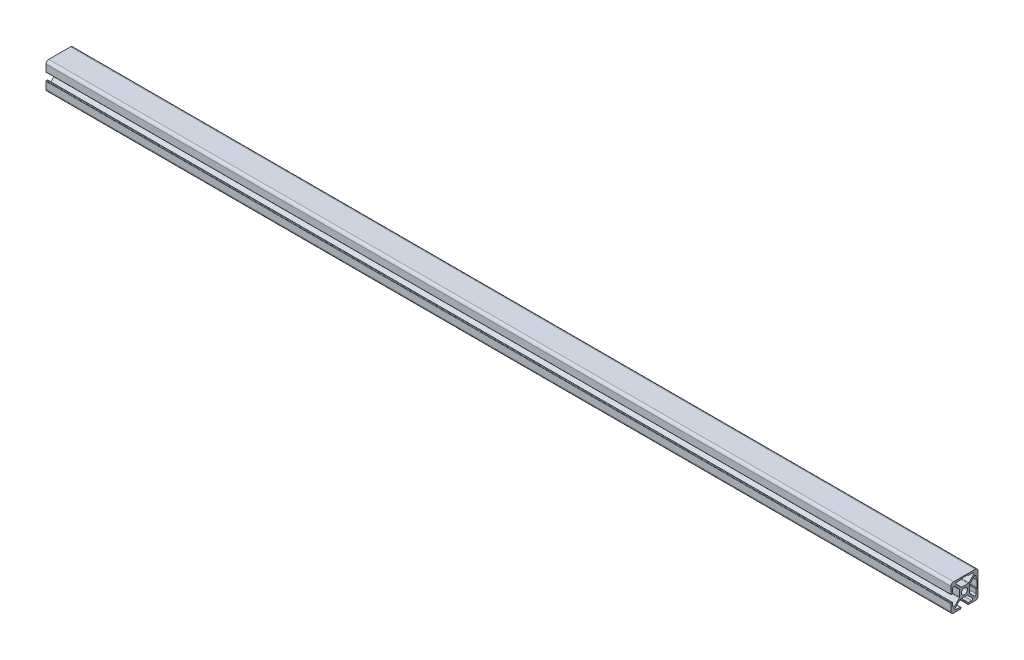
from build123d import *

# Parameters (mm, degrees)
MODEL_R                = 3.4
STRUKTURBAUTEIL1_DEPTH = 1000


with BuildPart() as part:
    # Model → Strukturbauteil1 (new body)
    with BuildSketch(Plane(origin=(0, 0, 0), x_dir=(0, 0, -1), z_dir=(1, 0, 0))):
        with BuildLine():
            Line((-14.5, 4), (-13.5, 4))
            ThreePointArc((-13.5, 4), (-13.146446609, 4.146446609), (-13, 4.5))
            Line((-13, 4.5), (-13, 9.1022583))
            ThreePointArc((-13, 9.1022583), (-12.198882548, 10.301215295), (-10.784616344, 10.019900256))
            Line((-10.784616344, 10.019900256), (-5.692893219, 4.928177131))
            ThreePointArc((-5.692893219, 4.928177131), (-5.476120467, 4.603753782), (-5.4, 4.22107035))
            Line((-5.4, 4.22107035), (-5.4, -3.02107035))
            ThreePointArc((-5.4, -3.02107035), (-5.476120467, -3.403753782), (-5.692893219, -3.728177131))
            Line((-5.692893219, -3.728177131), (-10.784616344, -8.819900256))
            ThreePointArc((-10.784616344, -8.819900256), (-12.198882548, -9.101215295), (-13, -7.9022583))
            Line((-13, -7.9022583), (-13, -4.5))
            ThreePointArc((-13, -4.5), (-13.146446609, -4.146446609), (-13.5, -4))
            Line((-13.5, -4), (-14.5, -4))
            ThreePointArc((-14.5, -4), (-14.853553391, -4.146446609), (-15, -4.5))
            Line((-15, -4.5), (-15, -12))
            ThreePointArc((-15, -12), (-14.121320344, -14.121320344), (-12, -15))
            Line((-12, -15), (-4.5, -15))
            ThreePointArc((-4.5, -15), (-4.146446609, -14.853553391), (-4, -14.5))
            Line((-4, -14.5), (-4, -13.5))
            ThreePointArc((-4, -13.5), (-4.146446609, -13.146446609), (-4.5, -13))
            Line((-4.5, -13), (-9.1022583, -13))
            ThreePointArc((-9.1022583, -13), (-10.301215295, -12.198882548), (-10.019900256, -10.784616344))
            Line((-10.019900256, -10.784616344), (-4.928177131, -5.692893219))
            ThreePointArc((-4.928177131, -5.692893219), (-4.603753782, -5.476120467), (-4.22107035, -5.4))
            Line((-4.22107035, -5.4), (3.02107035, -5.4))
            ThreePointArc((3.02107035, -5.4), (3.403753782, -5.476120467), (3.728177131, -5.692893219))
            Line((3.728177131, -5.692893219), (8.819900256, -10.784616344))
            ThreePointArc((8.819900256, -10.784616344), (9.101215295, -12.198882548), (7.9022583, -13))
            Line((7.9022583, -13), (4.5, -13))
            ThreePointArc((4.5, -13), (4.146446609, -13.146446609), (4, -13.5))
            Line((4, -13.5), (4, -14.5))
            ThreePointArc((4, -14.5), (4.146446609, -14.853553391), (4.5, -15))
            Line((4.5, -15), (12, -15))
            ThreePointArc((12, -15), (14.121320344, -14.121320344), (15, -12))
            Line((15, -12), (15, 12))
            ThreePointArc((15, 12), (14.121320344, 14.121320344), (12, 15))
            Line((12, 15), (-12, 15))
            ThreePointArc((-12, 15), (-14.121320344, 14.121320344), (-15, 12))
            Line((-15, 12), (-15, 4.5))
            ThreePointArc((-15, 4.5), (-14.853553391, 4.146446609), (-14.5, 4))
        make_face()
        Circle(MODEL_R, mode=Mode.SUBTRACT)
        with BuildLine():
            Line((13.8, 3.7), (13.8, -3.7))
            ThreePointArc((13.8, -3.7), (13.712132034, -3.912132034), (13.5, -4))
            ThreePointArc((13.5, -4), (13.146446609, -4.146446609), (13, -4.5))
            Line((13, -4.5), (13, -9.1022583))
            ThreePointArc((13, -9.1022583), (12.198882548, -10.301215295), (10.784616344, -10.019900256))
            Line((10.784616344, -10.019900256), (5.692893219, -4.928177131))
            ThreePointArc((5.692893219, -4.928177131), (5.476120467, -4.603753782), (5.4, -4.22107035))
            Line((5.4, -4.22107035), (5.4, 3.02107035))
            ThreePointArc((5.4, 3.02107035), (5.476120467, 3.403753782), (5.692893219, 3.728177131))
            Line((5.692893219, 3.728177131), (10.784616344, 8.819900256))
            ThreePointArc((10.784616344, 8.819900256), (12.198882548, 9.101215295), (13, 7.9022583))
            Line((13, 7.9022583), (13, 4.5))
            ThreePointArc((13, 4.5), (13.146446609, 4.146446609), (13.5, 4))
            ThreePointArc((13.5, 4), (13.712132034, 3.912132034), (13.8, 3.7))
        make_face(mode=Mode.SUBTRACT)
        with BuildLine():
            Line((3.7, 13.8), (-3.7, 13.8))
            ThreePointArc((-3.7, 13.8), (-3.912132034, 13.712132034), (-4, 13.5))
            ThreePointArc((-4, 13.5), (-4.146446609, 13.146446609), (-4.5, 13))
            Line((-4.5, 13), (-7.9022583, 13))
            ThreePointArc((-7.9022583, 13), (-9.101215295, 12.198882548), (-8.819900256, 10.784616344))
            Line((-8.819900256, 10.784616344), (-3.728177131, 5.692893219))
            ThreePointArc((-3.728177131, 5.692893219), (-3.403753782, 5.476120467), (-3.02107035, 5.4))
            Line((-3.02107035, 5.4), (4.22107035, 5.4))
            ThreePointArc((4.22107035, 5.4), (4.603753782, 5.476120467), (4.928177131, 5.692893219))
            Line((4.928177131, 5.692893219), (10.019900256, 10.784616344))
            ThreePointArc((10.019900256, 10.784616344), (10.301215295, 12.198882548), (9.1022583, 13))
            Line((9.1022583, 13), (4.5, 13))
            ThreePointArc((4.5, 13), (4.146446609, 13.146446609), (4, 13.5))
            ThreePointArc((4, 13.5), (3.912132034, 13.712132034), (3.7, 13.8))
        make_face(mode=Mode.SUBTRACT)
    extrude(amount=STRUKTURBAUTEIL1_DEPTH)


solid = part.part
